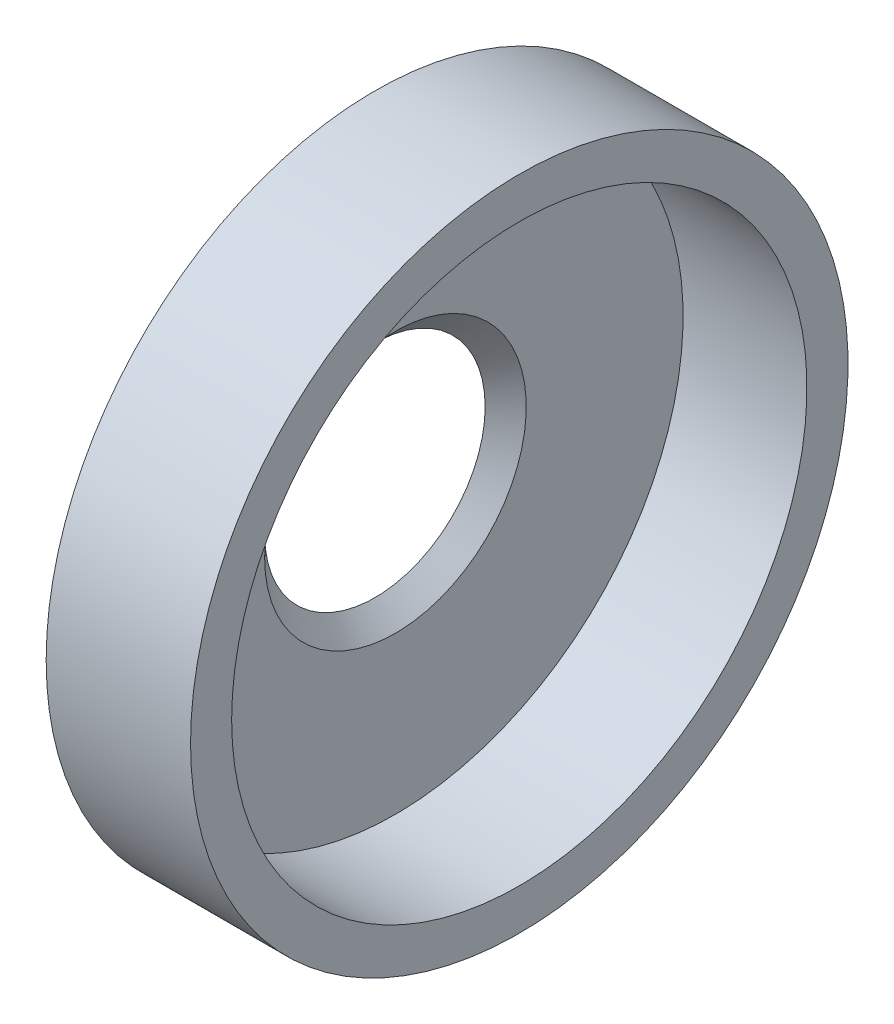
from build123d import *


with BuildPart() as part:
    # Sketch1 → Revolve1 (revolve)
    with BuildSketch(Plane.XY, mode=Mode.PRIVATE) as revolve1_sk:
        Polygon((0, 4.26), (0.79375, 5.05375), (0.79375, 11.1125), (5.5778, 11.1125), (5.5778, 12.7), (0, 12.7), align=None)
    revolve(revolve1_sk.sketch.rotate(Axis((0, 0, 0), (1, 0, 0)), 90), axis=Axis((0, 0, 0), (1, 0, 0)))


solid = part.part
